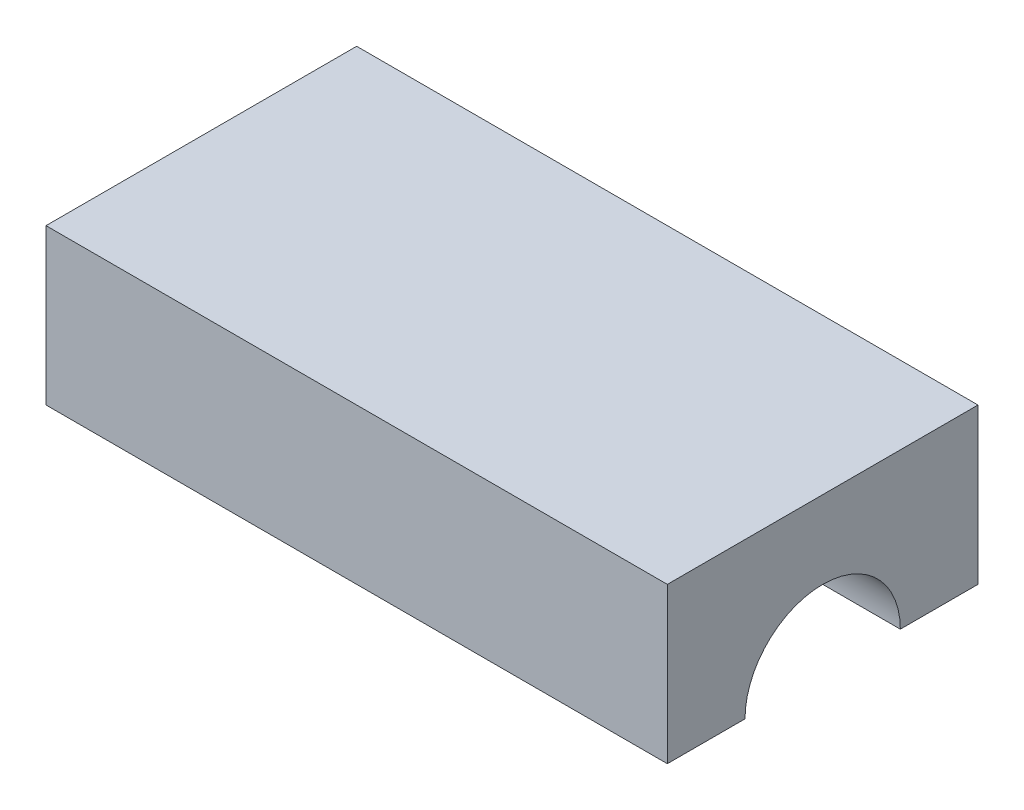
from build123d import *

# Parameters (mm, degrees)
SKETCH1_W           = 101.6
SKETCH1_H           = 50.8
BOSS_EXTRUDE1_DEPTH = 25.4
SKETCH2_R           = 12.7
CUT_EXTRUDE1_DEPTH  = 3.81
CUT_EXTRUDE2_START  = -48.26
SKETCH3_R           = 12.7
CUT_EXTRUDE2_DEPTH  = 48.26
SKETCH4_R           = 6.35
CUT_EXTRUDE3_DEPTH  = 45.72


with BuildPart() as part:
    # Sketch1 → Boss-Extrude1 (new body)
    with BuildSketch(Plane(origin=(0, 0, 0), x_dir=(1, 0, 0), z_dir=(0, 1, 0))):
        with Locations((50.8, -25.4)):
            Rectangle(SKETCH1_W, SKETCH1_H)
    extrude(amount=BOSS_EXTRUDE1_DEPTH)

    # Sketch2 → Cut-Extrude1 (cut)
    with BuildSketch(Plane.ZY):
        with Locations((25.4, 0)):
            Circle(SKETCH2_R)
    extrude(amount=-CUT_EXTRUDE1_DEPTH, mode=Mode.SUBTRACT)

    # Sketch3 → Cut-Extrude2 (cut)
    with BuildSketch(Plane(origin=(101.6, 0, 0), x_dir=(0, 0, -1), z_dir=(1, 0, 0)).offset(CUT_EXTRUDE2_START)):
        with Locations((-25.4, 0)):
            Circle(SKETCH3_R)
    extrude(amount=CUT_EXTRUDE2_DEPTH, mode=Mode.SUBTRACT)

    # Sketch4 → Cut-Extrude3 (cut)
    with BuildSketch(Plane.ZY.offset(-3.81)):
        with Locations((25.4, 0)):
            Circle(SKETCH4_R)
    extrude(amount=-CUT_EXTRUDE3_DEPTH, mode=Mode.SUBTRACT)

    # loft from a face of the part (cut_loft1)
    loft([part.faces().sort_by_distance((53.34, 5.390047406, 25.4))[0], part.faces().sort_by_distance((49.53, 2.695023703, 25.4))[0]], mode=Mode.SUBTRACT)


solid = part.part
